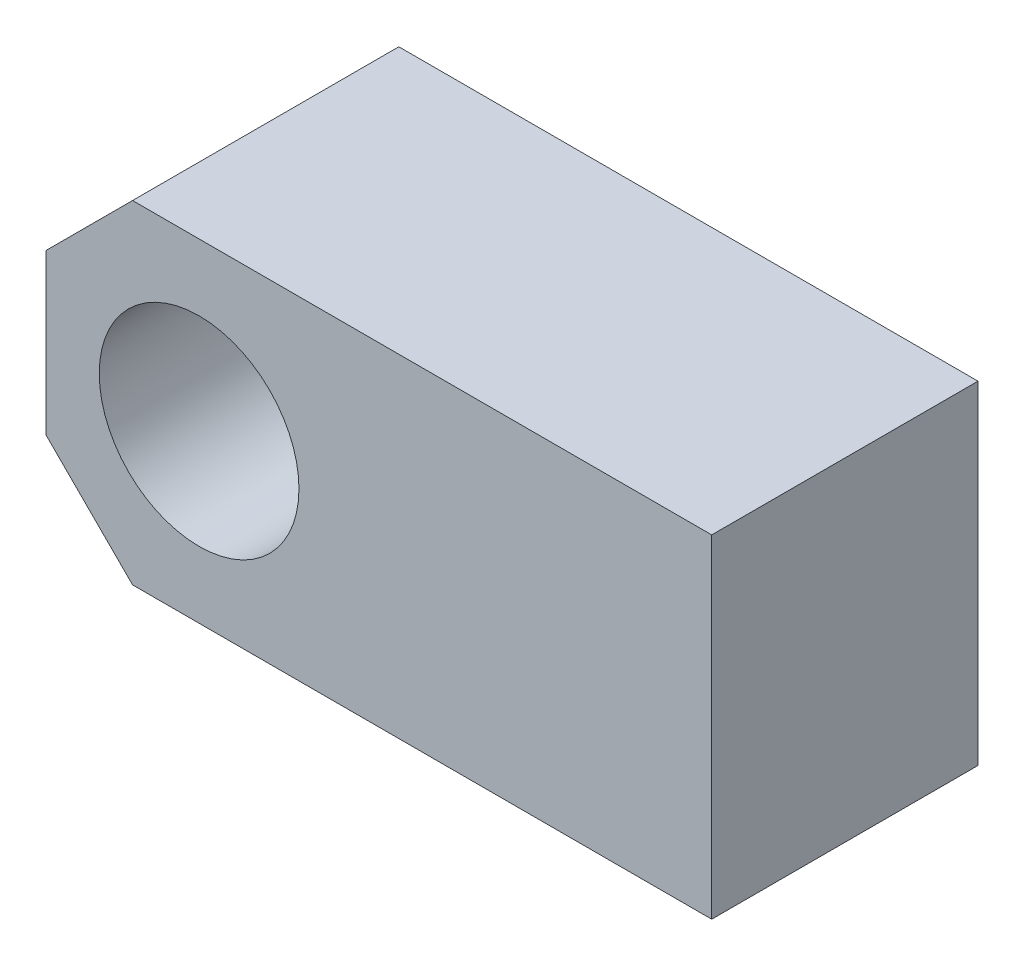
ISO-10303-21;
HEADER;
FILE_DESCRIPTION(('STEP AP214'),'2;1');
FILE_NAME('part.step','',(''),(''),'','','');
FILE_SCHEMA(('AUTOMOTIVE_DESIGN { 1 0 10303 214 1 1 1 1 }'));
ENDSEC;
DATA;
#1=APPLICATION_CONTEXT('core data for automotive mechanical design processes');
#2=APPLICATION_PROTOCOL_DEFINITION('international standard','automotive_design',2000,#1);
#3=PRODUCT_CONTEXT('',#1,'mechanical');
#4=PRODUCT('Part','Part','',(#3));
#5=PRODUCT_RELATED_PRODUCT_CATEGORY('part','',(#4));
#6=PRODUCT_DEFINITION_FORMATION('','',#4);
#7=PRODUCT_DEFINITION_CONTEXT('part definition',#1,'design');
#8=PRODUCT_DEFINITION('design','',#6,#7);
#9=PRODUCT_DEFINITION_SHAPE('','',#8);
#10=(LENGTH_UNIT() NAMED_UNIT(*) SI_UNIT(.MILLI.,.METRE.));
#11=(NAMED_UNIT(*) PLANE_ANGLE_UNIT() SI_UNIT($,.RADIAN.));
#12=(NAMED_UNIT(*) SI_UNIT($,.STERADIAN.) SOLID_ANGLE_UNIT());
#13=UNCERTAINTY_MEASURE_WITH_UNIT(LENGTH_MEASURE(1.E-05),#10,'distance_accuracy_value','');
#14=(GEOMETRIC_REPRESENTATION_CONTEXT(3) GLOBAL_UNCERTAINTY_ASSIGNED_CONTEXT((#13)) GLOBAL_UNIT_ASSIGNED_CONTEXT((#10,
#11,#12)) REPRESENTATION_CONTEXT('',''));
#15=CARTESIAN_POINT('',(0.,0.,0.));
#16=DIRECTION('',(0.,0.,1.));
#17=DIRECTION('',(1.,0.,0.));
#18=AXIS2_PLACEMENT_3D('',#15,#16,#17);
#19=CARTESIAN_POINT('',(0.,0.,40.));
#20=DIRECTION('',(0.,0.,1.));
#21=DIRECTION('',(1.,0.,0.));
#22=AXIS2_PLACEMENT_3D('',#19,#20,#21);
#23=PLANE('',#22);
#24=DIRECTION('',(0.,-1.,0.));
#25=VECTOR('',#24,1.);
#26=CARTESIAN_POINT('',(-100.,0.,40.));
#27=LINE('',#26,#25);
#28=CARTESIAN_POINT('',(-100.,36.9999999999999,40.));
#29=VERTEX_POINT('',#28);
#30=CARTESIAN_POINT('',(-100.,13.,40.));
#31=VERTEX_POINT('',#30);
#32=EDGE_CURVE('E102',#29,#31,#27,.T.);
#33=ORIENTED_EDGE('',*,*,#32,.T.);
#34=DIRECTION('',(-0.707106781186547,0.707106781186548,0.));
#35=VECTOR('',#34,1.);
#36=CARTESIAN_POINT('',(-43.5000000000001,-43.5,40.));
#37=LINE('',#36,#35);
#38=CARTESIAN_POINT('',(-87.,0.,40.));
#39=VERTEX_POINT('',#38);
#40=EDGE_CURVE('E50',#31,#39,#37,.F.);
#41=ORIENTED_EDGE('',*,*,#40,.T.);
#42=DIRECTION('',(1.,0.,0.));
#43=VECTOR('',#42,1.);
#44=CARTESIAN_POINT('',(0.,0.,40.));
#45=LINE('',#44,#43);
#46=CARTESIAN_POINT('',(0.,0.,40.));
#47=VERTEX_POINT('',#46);
#48=EDGE_CURVE('E108',#39,#47,#45,.T.);
#49=ORIENTED_EDGE('',*,*,#48,.T.);
#50=DIRECTION('',(0.,1.,0.));
#51=VECTOR('',#50,1.);
#52=CARTESIAN_POINT('',(0.,0.,40.));
#53=LINE('',#52,#51);
#54=CARTESIAN_POINT('',(0.,50.,40.));
#55=VERTEX_POINT('',#54);
#56=EDGE_CURVE('E103',#47,#55,#53,.T.);
#57=ORIENTED_EDGE('',*,*,#56,.T.);
#58=DIRECTION('',(-1.,0.,0.));
#59=VECTOR('',#58,1.);
#60=CARTESIAN_POINT('',(0.,50.,40.));
#61=LINE('',#60,#59);
#62=CARTESIAN_POINT('',(-86.9999999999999,50.,40.));
#63=VERTEX_POINT('',#62);
#64=EDGE_CURVE('E94',#55,#63,#61,.T.);
#65=ORIENTED_EDGE('',*,*,#64,.T.);
#66=DIRECTION('',(0.707106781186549,0.707106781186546,0.));
#67=VECTOR('',#66,1.);
#68=CARTESIAN_POINT('',(-68.4999999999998,68.5,40.));
#69=LINE('',#68,#67);
#70=EDGE_CURVE('E133',#63,#29,#69,.F.);
#71=ORIENTED_EDGE('',*,*,#70,.T.);
#72=EDGE_LOOP('',(#33,#41,#49,#57,#65,#71));
#73=FACE_BOUND('',#72,.T.);
#74=CARTESIAN_POINT('',(-77.,25.,40.));
#75=DIRECTION('',(0.,0.,1.));
#76=DIRECTION('',(1.,0.,0.));
#77=AXIS2_PLACEMENT_3D('',#74,#75,#76);
#78=CIRCLE('',#77,15.);
#79=CARTESIAN_POINT('',(-62.,25.,40.));
#80=VERTEX_POINT('',#79);
#81=EDGE_CURVE('E154',#80,#80,#78,.T.);
#82=ORIENTED_EDGE('',*,*,#81,.F.);
#83=EDGE_LOOP('',(#82));
#84=FACE_BOUND('',#83,.T.);
#85=ADVANCED_FACE('F37',(#73,#84),#23,.T.);
#86=CARTESIAN_POINT('',(0.,0.,0.));
#87=DIRECTION('',(0.,0.,1.));
#88=DIRECTION('',(1.,0.,0.));
#89=AXIS2_PLACEMENT_3D('',#86,#87,#88);
#90=PLANE('',#89);
#91=DIRECTION('',(1.,0.,0.));
#92=VECTOR('',#91,1.);
#93=CARTESIAN_POINT('',(0.,0.,0.));
#94=LINE('',#93,#92);
#95=CARTESIAN_POINT('',(-87.,0.,0.));
#96=VERTEX_POINT('',#95);
#97=CARTESIAN_POINT('',(0.,0.,0.));
#98=VERTEX_POINT('',#97);
#99=EDGE_CURVE('E112',#96,#98,#94,.T.);
#100=ORIENTED_EDGE('',*,*,#99,.F.);
#101=DIRECTION('',(0.707106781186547,-0.707106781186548,0.));
#102=VECTOR('',#101,1.);
#103=CARTESIAN_POINT('',(-87.,0.,0.));
#104=LINE('',#103,#102);
#105=CARTESIAN_POINT('',(-100.,13.,0.));
#106=VERTEX_POINT('',#105);
#107=EDGE_CURVE('E127',#96,#106,#104,.F.);
#108=ORIENTED_EDGE('',*,*,#107,.T.);
#109=DIRECTION('',(0.,-1.,0.));
#110=VECTOR('',#109,1.);
#111=CARTESIAN_POINT('',(-100.,0.,0.));
#112=LINE('',#111,#110);
#113=CARTESIAN_POINT('',(-100.,37.,0.));
#114=VERTEX_POINT('',#113);
#115=EDGE_CURVE('E147',#114,#106,#112,.T.);
#116=ORIENTED_EDGE('',*,*,#115,.F.);
#117=DIRECTION('',(-0.707106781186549,-0.707106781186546,0.));
#118=VECTOR('',#117,1.);
#119=CARTESIAN_POINT('',(-100.,37.,0.));
#120=LINE('',#119,#118);
#121=CARTESIAN_POINT('',(-86.9999999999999,50.,0.));
#122=VERTEX_POINT('',#121);
#123=EDGE_CURVE('E121',#114,#122,#120,.F.);
#124=ORIENTED_EDGE('',*,*,#123,.T.);
#125=DIRECTION('',(-1.,0.,0.));
#126=VECTOR('',#125,1.);
#127=CARTESIAN_POINT('',(0.,50.,0.));
#128=LINE('',#127,#126);
#129=CARTESIAN_POINT('',(0.,50.,0.));
#130=VERTEX_POINT('',#129);
#131=EDGE_CURVE('E150',#130,#122,#128,.T.);
#132=ORIENTED_EDGE('',*,*,#131,.F.);
#133=DIRECTION('',(0.,1.,0.));
#134=VECTOR('',#133,1.);
#135=CARTESIAN_POINT('',(0.,0.,0.));
#136=LINE('',#135,#134);
#137=EDGE_CURVE('E116',#98,#130,#136,.T.);
#138=ORIENTED_EDGE('',*,*,#137,.F.);
#139=EDGE_LOOP('',(#100,#108,#116,#124,#132,#138));
#140=FACE_BOUND('',#139,.T.);
#141=CARTESIAN_POINT('',(-77.,25.,0.));
#142=DIRECTION('',(0.,0.,1.));
#143=DIRECTION('',(1.,0.,0.));
#144=AXIS2_PLACEMENT_3D('',#141,#142,#143);
#145=CIRCLE('',#144,15.);
#146=CARTESIAN_POINT('',(-62.,25.,0.));
#147=VERTEX_POINT('',#146);
#148=EDGE_CURVE('E157',#147,#147,#145,.T.);
#149=ORIENTED_EDGE('',*,*,#148,.T.);
#150=EDGE_LOOP('',(#149));
#151=FACE_BOUND('',#150,.T.);
#152=ADVANCED_FACE('F145',(#140,#151),#90,.F.);
#153=CARTESIAN_POINT('',(0.,0.,40.));
#154=DIRECTION('',(-1.,0.,0.));
#155=DIRECTION('',(0.,0.,1.));
#156=AXIS2_PLACEMENT_3D('',#153,#154,#155);
#157=PLANE('',#156);
#158=ORIENTED_EDGE('',*,*,#137,.T.);
#159=DIRECTION('',(0.,0.,-1.));
#160=VECTOR('',#159,1.);
#161=CARTESIAN_POINT('',(0.,50.,40.));
#162=LINE('',#161,#160);
#163=EDGE_CURVE('E98',#55,#130,#162,.T.);
#164=ORIENTED_EDGE('',*,*,#163,.F.);
#165=ORIENTED_EDGE('',*,*,#56,.F.);
#166=DIRECTION('',(0.,0.,-1.));
#167=VECTOR('',#166,1.);
#168=CARTESIAN_POINT('',(0.,0.,40.));
#169=LINE('',#168,#167);
#170=EDGE_CURVE('E118',#47,#98,#169,.T.);
#171=ORIENTED_EDGE('',*,*,#170,.T.);
#172=EDGE_LOOP('',(#158,#164,#165,#171));
#173=FACE_BOUND('',#172,.T.);
#174=ADVANCED_FACE('F114',(#173),#157,.F.);
#175=CARTESIAN_POINT('',(0.,50.,40.));
#176=DIRECTION('',(0.,-1.,0.));
#177=DIRECTION('',(1.,0.,0.));
#178=AXIS2_PLACEMENT_3D('',#175,#176,#177);
#179=PLANE('',#178);
#180=ORIENTED_EDGE('',*,*,#131,.T.);
#181=DIRECTION('',(0.,0.,1.));
#182=VECTOR('',#181,1.);
#183=CARTESIAN_POINT('',(-86.9999999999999,50.,40.));
#184=LINE('',#183,#182);
#185=EDGE_CURVE('E11',#122,#63,#184,.T.);
#186=ORIENTED_EDGE('',*,*,#185,.T.);
#187=ORIENTED_EDGE('',*,*,#64,.F.);
#188=ORIENTED_EDGE('',*,*,#163,.T.);
#189=EDGE_LOOP('',(#180,#186,#187,#188));
#190=FACE_BOUND('',#189,.T.);
#191=ADVANCED_FACE('F96',(#190),#179,.F.);
#192=CARTESIAN_POINT('',(-100.,0.,40.));
#193=DIRECTION('',(1.,0.,0.));
#194=DIRECTION('',(0.,0.,-1.));
#195=AXIS2_PLACEMENT_3D('',#192,#193,#194);
#196=PLANE('',#195);
#197=ORIENTED_EDGE('',*,*,#115,.T.);
#198=DIRECTION('',(0.,0.,1.));
#199=VECTOR('',#198,1.);
#200=CARTESIAN_POINT('',(-100.,13.,40.));
#201=LINE('',#200,#199);
#202=EDGE_CURVE('E63',#106,#31,#201,.T.);
#203=ORIENTED_EDGE('',*,*,#202,.T.);
#204=ORIENTED_EDGE('',*,*,#32,.F.);
#205=DIRECTION('',(0.,0.,-1.));
#206=VECTOR('',#205,1.);
#207=CARTESIAN_POINT('',(-100.,37.,40.));
#208=LINE('',#207,#206);
#209=EDGE_CURVE('E129',#29,#114,#208,.T.);
#210=ORIENTED_EDGE('',*,*,#209,.T.);
#211=EDGE_LOOP('',(#197,#203,#204,#210));
#212=FACE_BOUND('',#211,.T.);
#213=ADVANCED_FACE('F148',(#212),#196,.F.);
#214=CARTESIAN_POINT('',(0.,0.,40.));
#215=DIRECTION('',(0.,1.,0.));
#216=DIRECTION('',(-1.,0.,0.));
#217=AXIS2_PLACEMENT_3D('',#214,#215,#216);
#218=PLANE('',#217);
#219=CARTESIAN_POINT('',(-77.,0.,20.));
#220=DIRECTION('',(0.,-1.,0.));
#221=DIRECTION('',(0.,0.,-1.));
#222=AXIS2_PLACEMENT_3D('',#219,#220,#221);
#223=CIRCLE('',#222,3.4);
#224=CARTESIAN_POINT('',(-77.,0.,16.6));
#225=VERTEX_POINT('',#224);
#226=EDGE_CURVE('E162',#225,#225,#223,.T.);
#227=ORIENTED_EDGE('',*,*,#226,.F.);
#228=EDGE_LOOP('',(#227));
#229=FACE_BOUND('',#228,.T.);
#230=ORIENTED_EDGE('',*,*,#48,.F.);
#231=DIRECTION('',(0.,0.,-1.));
#232=VECTOR('',#231,1.);
#233=CARTESIAN_POINT('',(-87.,0.,40.));
#234=LINE('',#233,#232);
#235=EDGE_CURVE('E117',#39,#96,#234,.T.);
#236=ORIENTED_EDGE('',*,*,#235,.T.);
#237=ORIENTED_EDGE('',*,*,#99,.T.);
#238=ORIENTED_EDGE('',*,*,#170,.F.);
#239=EDGE_LOOP('',(#230,#236,#237,#238));
#240=FACE_BOUND('',#239,.T.);
#241=ADVANCED_FACE('F139',(#229,#240),#218,.F.);
#242=CARTESIAN_POINT('',(-77.,25.,40.));
#243=DIRECTION('',(0.,0.,-1.));
#244=DIRECTION('',(-1.,0.,0.));
#245=AXIS2_PLACEMENT_3D('',#242,#243,#244);
#246=CYLINDRICAL_SURFACE('',#245,15.);
#247=CARTESIAN_POINT('',(-77.,9.99999999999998,16.6));
#248=CARTESIAN_POINT('',(-77.1883984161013,10.0000034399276,16.6000061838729));
#249=CARTESIAN_POINT('',(-77.3768701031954,10.0035852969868,16.6157119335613));
#250=CARTESIAN_POINT('',(-77.7484482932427,10.0175278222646,16.6780477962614));
#251=CARTESIAN_POINT('',(-77.9315510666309,10.0278930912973,16.7246988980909));
#252=CARTESIAN_POINT('',(-78.2869686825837,10.0542498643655,16.8473799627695));
#253=CARTESIAN_POINT('',(-78.4592949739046,10.0702352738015,16.9233781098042));
#254=CARTESIAN_POINT('',(-78.788746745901,10.1061126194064,17.1024922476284));
#255=CARTESIAN_POINT('',(-78.9458723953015,10.1260045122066,17.2056079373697));
#256=CARTESIAN_POINT('',(-79.2431629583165,10.167902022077,17.4379015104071));
#257=CARTESIAN_POINT('',(-79.3830297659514,10.1899354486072,17.5674559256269));
#258=CARTESIAN_POINT('',(-79.6392459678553,10.2334395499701,17.8481415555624));
#259=CARTESIAN_POINT('',(-79.7555931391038,10.254910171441,17.9992748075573));
#260=CARTESIAN_POINT('',(-79.962803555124,10.2951332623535,18.3210588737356));
#261=CARTESIAN_POINT('',(-80.0533455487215,10.3138501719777,18.4919213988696));
#262=CARTESIAN_POINT('',(-80.2043135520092,10.3460458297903,18.8469317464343));
#263=CARTESIAN_POINT('',(-80.2647434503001,10.3595252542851,19.0310778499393));
#264=CARTESIAN_POINT('',(-80.3527789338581,10.3794358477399,19.4041832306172));
#265=CARTESIAN_POINT('',(-80.3809143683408,10.3859806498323,19.593011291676));
#266=CARTESIAN_POINT('',(-80.4052104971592,10.3916219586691,19.9728121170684));
#267=CARTESIAN_POINT('',(-80.4013754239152,10.3907194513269,20.1637845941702));
#268=CARTESIAN_POINT('',(-80.3622649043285,10.3816708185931,20.5384853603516));
#269=CARTESIAN_POINT('',(-80.3276087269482,10.3736673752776,20.7222822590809));
#270=CARTESIAN_POINT('',(-80.2288225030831,10.3515446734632,21.081383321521));
#271=CARTESIAN_POINT('',(-80.1646906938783,10.3374250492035,21.2566869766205));
#272=CARTESIAN_POINT('',(-80.0082150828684,10.3045226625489,21.5955466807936));
#273=CARTESIAN_POINT('',(-79.9156364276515,10.2857013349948,21.7589903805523));
#274=CARTESIAN_POINT('',(-79.7050599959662,10.2455394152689,22.0682503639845));
#275=CARTESIAN_POINT('',(-79.5870585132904,10.2241984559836,22.2140640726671));
#276=CARTESIAN_POINT('',(-79.3257249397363,10.180792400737,22.4874864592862));
#277=CARTESIAN_POINT('',(-79.1818671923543,10.1587220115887,22.6145924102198));
#278=CARTESIAN_POINT('',(-78.8746237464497,10.116795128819,22.8429602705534));
#279=CARTESIAN_POINT('',(-78.711237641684,10.0969386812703,22.9442216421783));
#280=CARTESIAN_POINT('',(-78.36893681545,10.061604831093,23.1181644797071));
#281=CARTESIAN_POINT('',(-78.1899855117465,10.0461381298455,23.190776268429));
#282=CARTESIAN_POINT('',(-77.8219918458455,10.0214054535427,23.3047565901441));
#283=CARTESIAN_POINT('',(-77.6329510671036,10.0121385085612,23.3461300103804));
#284=CARTESIAN_POINT('',(-77.2544534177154,10.0009888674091,23.3957191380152));
#285=CARTESIAN_POINT('',(-77.0650908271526,9.99895337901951,23.4046210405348));
#286=CARTESIAN_POINT('',(-76.6875839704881,10.0020661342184,23.3908796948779));
#287=CARTESIAN_POINT('',(-76.499439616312,10.0072138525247,23.3682387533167));
#288=CARTESIAN_POINT('',(-76.1320104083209,10.0240178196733,23.2926227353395));
#289=CARTESIAN_POINT('',(-75.9526468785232,10.0355960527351,23.2400110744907));
#290=CARTESIAN_POINT('',(-75.6052926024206,10.0639634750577,23.1063532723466));
#291=CARTESIAN_POINT('',(-75.4373028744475,10.0807531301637,23.025304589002));
#292=CARTESIAN_POINT('',(-75.1146531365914,10.1180556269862,22.8356680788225));
#293=CARTESIAN_POINT('',(-74.9602336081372,10.1386210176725,22.7266816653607));
#294=CARTESIAN_POINT('',(-74.6716293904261,10.181092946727,22.4847844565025));
#295=CARTESIAN_POINT('',(-74.5374475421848,10.2029996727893,22.3518703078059));
#296=CARTESIAN_POINT('',(-74.2903863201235,10.2462185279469,22.0627317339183));
#297=CARTESIAN_POINT('',(-74.177983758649,10.2675101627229,21.906096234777));
#298=CARTESIAN_POINT('',(-73.9810741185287,10.3065931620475,21.5757703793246));
#299=CARTESIAN_POINT('',(-73.8965658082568,10.3243846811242,21.4020807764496));
#300=CARTESIAN_POINT('',(-73.7584335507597,10.3542755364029,21.0435210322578));
#301=CARTESIAN_POINT('',(-73.7046318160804,10.3664075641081,20.8587222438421));
#302=CARTESIAN_POINT('',(-73.6289293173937,10.3836592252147,20.4823940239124));
#303=CARTESIAN_POINT('',(-73.6070230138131,10.3887800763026,20.2908657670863));
#304=CARTESIAN_POINT('',(-73.5959823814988,10.3913488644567,19.9113329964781));
#305=CARTESIAN_POINT('',(-73.6060907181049,10.3889741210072,19.723351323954));
#306=CARTESIAN_POINT('',(-73.657089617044,10.3772224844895,19.3518455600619));
#307=CARTESIAN_POINT('',(-73.6979797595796,10.367845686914,19.168321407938));
#308=CARTESIAN_POINT('',(-73.8090036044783,10.343236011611,18.811595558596));
#309=CARTESIAN_POINT('',(-73.879019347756,10.3280267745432,18.6383554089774));
#310=CARTESIAN_POINT('',(-74.0462083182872,10.293458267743,18.3059710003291));
#311=CARTESIAN_POINT('',(-74.1433846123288,10.2740985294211,18.1468283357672));
#312=CARTESIAN_POINT('',(-74.3646146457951,10.2328864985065,17.8434405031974));
#313=CARTESIAN_POINT('',(-74.4892047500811,10.2109893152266,17.6995924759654));
#314=CARTESIAN_POINT('',(-74.7606486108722,10.1674626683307,17.4345975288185));
#315=CARTESIAN_POINT('',(-74.9075075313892,10.1458332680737,17.313455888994));
#316=CARTESIAN_POINT('',(-75.221827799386,10.104915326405,17.095662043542));
#317=CARTESIAN_POINT('',(-75.3895514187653,10.0856642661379,16.9993808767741));
#318=CARTESIAN_POINT('',(-75.7392084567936,10.0520521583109,16.8365311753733));
#319=CARTESIAN_POINT('',(-75.9211302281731,10.0376871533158,16.769938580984));
#320=CARTESIAN_POINT('',(-76.2526007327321,10.0179242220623,16.6797523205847));
#321=CARTESIAN_POINT('',(-76.4004033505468,10.011245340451,16.6499040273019));
#322=CARTESIAN_POINT('',(-76.6987884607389,10.0022819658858,16.6100258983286));
#323=CARTESIAN_POINT('',(-76.8493708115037,9.99999724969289,16.5999950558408));
#324=CARTESIAN_POINT('',(-77.,9.99999999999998,16.6));
#325=B_SPLINE_CURVE_WITH_KNOTS('',3,(#247,#248,#249,#250,#251,#252,#253,#254,#255,#256,#257,
#258,#259,#260,#261,#262,#263,#264,#265,#266,#267,#268,#269,#270,#271,#272,#273,#274,#275,#276,
#277,#278,#279,#280,#281,#282,#283,#284,#285,#286,#287,#288,#289,#290,#291,#292,#293,#294,#295,
#296,#297,#298,#299,#300,#301,#302,#303,#304,#305,#306,#307,#308,#309,#310,#311,#312,#313,#314,
#315,#316,#317,#318,#319,#320,#321,#322,#323,#324),.UNSPECIFIED.,.T.,.F.,(4,2,2,2,2,2,2,2,2,2,2,
2,2,2,2,2,2,2,2,2,2,2,2,2,2,2,2,2,2,2,2,2,2,2,2,2,2,2,4),(0.,0.564643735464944,1.12967083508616,
1.69408708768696,2.25849707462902,2.83158982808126,3.40473672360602,3.98473482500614,
4.56465800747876,5.13492402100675,5.70511454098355,6.26410109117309,6.82312107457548,
7.38688623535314,7.95073363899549,8.52770490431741,9.10468817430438,9.6830661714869,
10.2613536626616,10.8273474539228,11.3932998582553,11.952531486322,12.5118131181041,
13.0795672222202,13.6474009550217,14.2265293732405,14.8056322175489,15.3813471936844,
15.9569621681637,16.5190630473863,17.0811562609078,17.640994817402,18.2008966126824,
18.7729206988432,19.3450776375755,19.925335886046,20.5051230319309,20.9565925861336,
21.4080392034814),.UNSPECIFIED.);
#326=CARTESIAN_POINT('',(-77.,9.99999999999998,16.6));
#327=VERTEX_POINT('',#326);
#328=EDGE_CURVE('E41',#327,#327,#325,.T.);
#329=ORIENTED_EDGE('',*,*,#328,.F.);
#330=EDGE_LOOP('',(#329));
#331=FACE_BOUND('',#330,.T.);
#332=ORIENTED_EDGE('',*,*,#81,.T.);
#333=EDGE_LOOP('',(#332));
#334=FACE_BOUND('',#333,.T.);
#335=ORIENTED_EDGE('',*,*,#148,.F.);
#336=EDGE_LOOP('',(#335));
#337=FACE_BOUND('',#336,.T.);
#338=ADVANCED_FACE('F171',(#331,#334,#337),#246,.F.);
#339=CARTESIAN_POINT('',(-87.,0.,40.));
#340=DIRECTION('',(0.707106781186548,0.707106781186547,0.));
#341=DIRECTION('',(0.,0.,-1.));
#342=AXIS2_PLACEMENT_3D('',#339,#340,#341);
#343=PLANE('',#342);
#344=ORIENTED_EDGE('',*,*,#40,.F.);
#345=ORIENTED_EDGE('',*,*,#202,.F.);
#346=ORIENTED_EDGE('',*,*,#107,.F.);
#347=ORIENTED_EDGE('',*,*,#235,.F.);
#348=EDGE_LOOP('',(#344,#345,#346,#347));
#349=FACE_BOUND('',#348,.T.);
#350=ADVANCED_FACE('F142',(#349),#343,.F.);
#351=CARTESIAN_POINT('',(-100.,37.,40.));
#352=DIRECTION('',(0.707106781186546,-0.707106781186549,0.));
#353=DIRECTION('',(0.,0.,-1.));
#354=AXIS2_PLACEMENT_3D('',#351,#352,#353);
#355=PLANE('',#354);
#356=ORIENTED_EDGE('',*,*,#70,.F.);
#357=ORIENTED_EDGE('',*,*,#185,.F.);
#358=ORIENTED_EDGE('',*,*,#123,.F.);
#359=ORIENTED_EDGE('',*,*,#209,.F.);
#360=EDGE_LOOP('',(#356,#357,#358,#359));
#361=FACE_BOUND('',#360,.T.);
#362=ADVANCED_FACE('F39',(#361),#355,.F.);
#363=CARTESIAN_POINT('',(-77.,0.,20.));
#364=DIRECTION('',(0.,-1.,0.));
#365=DIRECTION('',(0.,0.,-1.));
#366=AXIS2_PLACEMENT_3D('',#363,#364,#365);
#367=CYLINDRICAL_SURFACE('',#366,3.4);
#368=ORIENTED_EDGE('',*,*,#328,.T.);
#369=EDGE_LOOP('',(#368));
#370=FACE_BOUND('',#369,.T.);
#371=ORIENTED_EDGE('',*,*,#226,.T.);
#372=EDGE_LOOP('',(#371));
#373=FACE_BOUND('',#372,.T.);
#374=ADVANCED_FACE('F169',(#370,#373),#367,.F.);
#375=CLOSED_SHELL('',(#85,#152,#174,#191,#213,#241,#338,#350,#362,#374));
#376=MANIFOLD_SOLID_BREP('B2',#375);
#377=ADVANCED_BREP_SHAPE_REPRESENTATION('',(#18,#376),#14);
#378=SHAPE_DEFINITION_REPRESENTATION(#9,#377);
ENDSEC;
END-ISO-10303-21;
